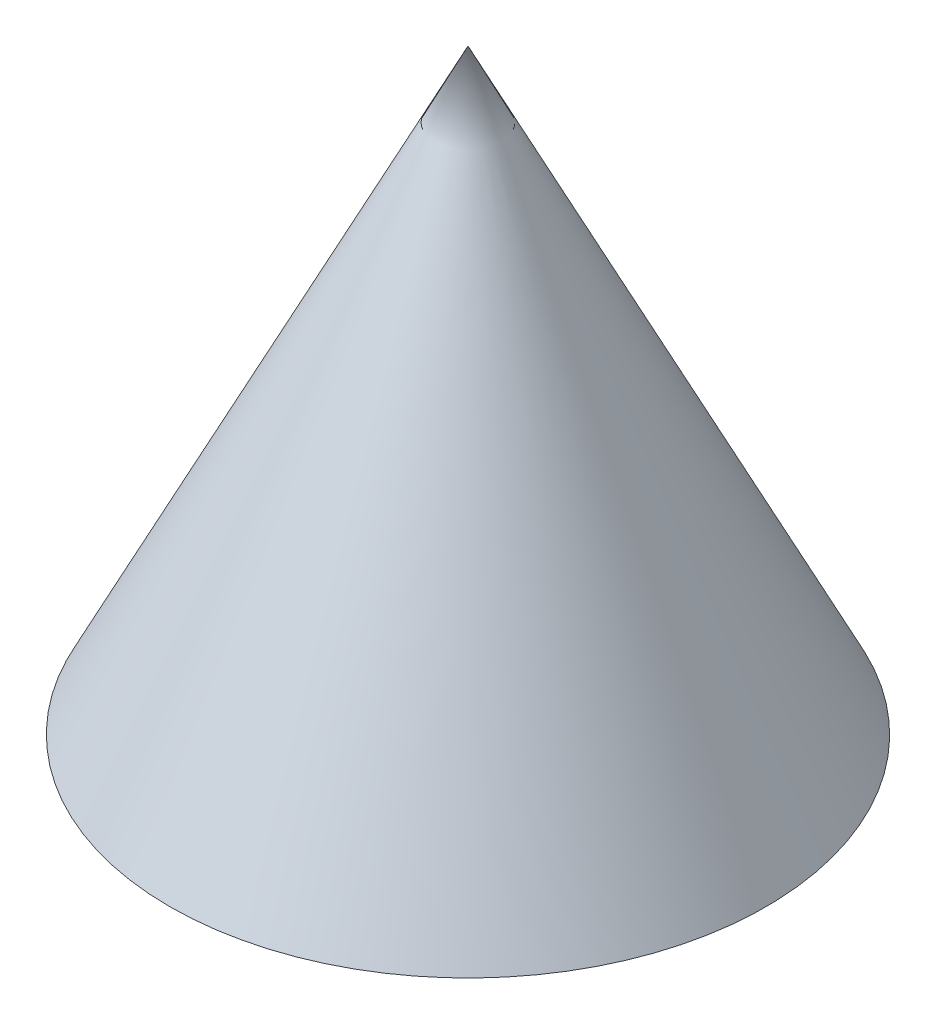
from build123d import *

# Parameters (mm, degrees)
SKETCH_1_R = 40


with BuildPart() as part:
    # Sketch 1 → Loft 1 section 0
    with BuildSketch(Plane(origin=(0, 0, 0), x_dir=(1, 0, 0), z_dir=(0, 1, 0)), mode=Mode.PRIVATE) as loft_1_s0:
        Circle(SKETCH_1_R)
    loft([Vertex(0, 80, 0), loft_1_s0.sketch])


solid = part.part
